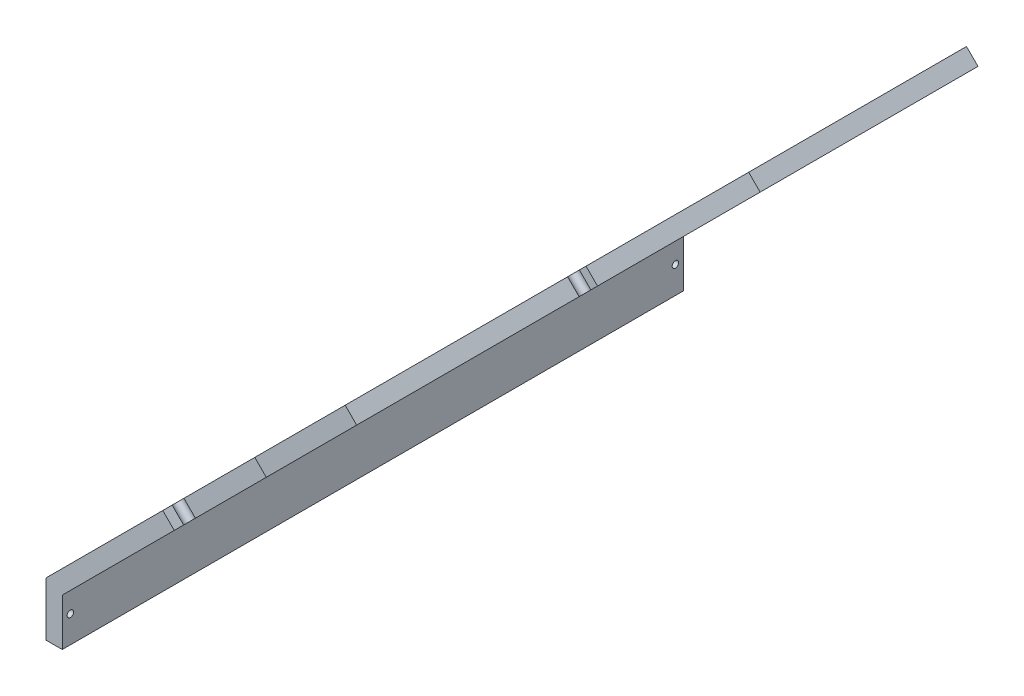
ISO-10303-21;
HEADER;
FILE_DESCRIPTION(('STEP AP214'),'2;1');
FILE_NAME('part.step','',(''),(''),'','','');
FILE_SCHEMA(('AUTOMOTIVE_DESIGN { 1 0 10303 214 1 1 1 1 }'));
ENDSEC;
DATA;
#1=APPLICATION_CONTEXT('core data for automotive mechanical design processes');
#2=APPLICATION_PROTOCOL_DEFINITION('international standard','automotive_design',2000,#1);
#3=PRODUCT_CONTEXT('',#1,'mechanical');
#4=PRODUCT('Part','Part','',(#3));
#5=PRODUCT_RELATED_PRODUCT_CATEGORY('part','',(#4));
#6=PRODUCT_DEFINITION_FORMATION('','',#4);
#7=PRODUCT_DEFINITION_CONTEXT('part definition',#1,'design');
#8=PRODUCT_DEFINITION('design','',#6,#7);
#9=PRODUCT_DEFINITION_SHAPE('','',#8);
#10=(LENGTH_UNIT() NAMED_UNIT(*) SI_UNIT(.MILLI.,.METRE.));
#11=(NAMED_UNIT(*) PLANE_ANGLE_UNIT() SI_UNIT($,.RADIAN.));
#12=(NAMED_UNIT(*) SI_UNIT($,.STERADIAN.) SOLID_ANGLE_UNIT());
#13=UNCERTAINTY_MEASURE_WITH_UNIT(LENGTH_MEASURE(1.E-05),#10,'distance_accuracy_value','');
#14=(GEOMETRIC_REPRESENTATION_CONTEXT(3) GLOBAL_UNCERTAINTY_ASSIGNED_CONTEXT((#13)) GLOBAL_UNIT_ASSIGNED_CONTEXT((#10,
#11,#12)) REPRESENTATION_CONTEXT('',''));
#15=CARTESIAN_POINT('',(0.,0.,0.));
#16=DIRECTION('',(0.,0.,1.));
#17=DIRECTION('',(1.,0.,0.));
#18=AXIS2_PLACEMENT_3D('',#15,#16,#17);
#19=CARTESIAN_POINT('',(0.,0.,191.));
#20=DIRECTION('',(0.,0.,-1.));
#21=DIRECTION('',(-1.,0.,0.));
#22=AXIS2_PLACEMENT_3D('',#19,#20,#21);
#23=PLANE('',#22);
#24=DIRECTION('',(0.707106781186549,0.707106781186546,0.));
#25=VECTOR('',#24,1.);
#26=CARTESIAN_POINT('',(90.5025969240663,105.002596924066,191.));
#27=LINE('',#26,#25);
#28=CARTESIAN_POINT('',(0.,14.5,191.));
#29=VERTEX_POINT('',#28);
#30=CARTESIAN_POINT('',(34.431457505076,48.9314575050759,191.));
#31=VERTEX_POINT('',#30);
#32=EDGE_CURVE('E299',#29,#31,#27,.T.);
#33=ORIENTED_EDGE('',*,*,#32,.T.);
#34=DIRECTION('',(-0.707106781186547,0.707106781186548,0.));
#35=VECTOR('',#34,1.);
#36=CARTESIAN_POINT('',(41.681457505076,41.6814575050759,191.));
#37=LINE('',#36,#35);
#38=CARTESIAN_POINT('',(30.8959235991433,52.4669914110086,191.));
#39=VERTEX_POINT('',#38);
#40=EDGE_CURVE('E261',#31,#39,#37,.T.);
#41=ORIENTED_EDGE('',*,*,#40,.T.);
#42=DIRECTION('',(-0.707106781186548,-0.707106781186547,0.));
#43=VECTOR('',#42,1.);
#44=CARTESIAN_POINT('',(-4.99999999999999,16.5710678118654,191.));
#45=LINE('',#44,#43);
#46=CARTESIAN_POINT('',(-4.99999999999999,16.5710678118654,191.));
#47=VERTEX_POINT('',#46);
#48=EDGE_CURVE('E303',#39,#47,#45,.T.);
#49=ORIENTED_EDGE('',*,*,#48,.T.);
#50=DIRECTION('',(0.,-1.,0.));
#51=VECTOR('',#50,1.);
#52=CARTESIAN_POINT('',(-5.,0.,191.));
#53=LINE('',#52,#51);
#54=CARTESIAN_POINT('',(-5.,0.,191.));
#55=VERTEX_POINT('',#54);
#56=EDGE_CURVE('E305',#47,#55,#53,.T.);
#57=ORIENTED_EDGE('',*,*,#56,.T.);
#58=DIRECTION('',(1.,0.,0.));
#59=VECTOR('',#58,1.);
#60=CARTESIAN_POINT('',(0.,0.,191.));
#61=LINE('',#60,#59);
#62=CARTESIAN_POINT('',(0.,0.,191.));
#63=VERTEX_POINT('',#62);
#64=EDGE_CURVE('E307',#55,#63,#61,.T.);
#65=ORIENTED_EDGE('',*,*,#64,.T.);
#66=DIRECTION('',(0.,1.,0.));
#67=VECTOR('',#66,1.);
#68=CARTESIAN_POINT('',(0.,14.5,191.));
#69=LINE('',#68,#67);
#70=EDGE_CURVE('E294',#63,#29,#69,.T.);
#71=ORIENTED_EDGE('',*,*,#70,.T.);
#72=EDGE_LOOP('',(#33,#41,#49,#57,#65,#71));
#73=FACE_BOUND('',#72,.T.);
#74=ADVANCED_FACE('F33',(#73),#23,.F.);
#75=CARTESIAN_POINT('',(0.,0.,0.));
#76=DIRECTION('',(0.,0.,-1.));
#77=DIRECTION('',(-1.,0.,0.));
#78=AXIS2_PLACEMENT_3D('',#75,#76,#77);
#79=PLANE('',#78);
#80=DIRECTION('',(0.707106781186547,-0.707106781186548,0.));
#81=VECTOR('',#80,1.);
#82=CARTESIAN_POINT('',(69.965728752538,69.9657287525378,0.));
#83=LINE('',#82,#81);
#84=CARTESIAN_POINT('',(59.1801948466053,80.7512626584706,0.));
#85=VERTEX_POINT('',#84);
#86=CARTESIAN_POINT('',(62.715728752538,77.2157287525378,0.));
#87=VERTEX_POINT('',#86);
#88=EDGE_CURVE('E257',#85,#87,#83,.T.);
#89=ORIENTED_EDGE('',*,*,#88,.F.);
#90=DIRECTION('',(-0.707106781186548,-0.707106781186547,0.));
#91=VECTOR('',#90,1.);
#92=CARTESIAN_POINT('',(-4.99999999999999,16.5710678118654,0.));
#93=LINE('',#92,#91);
#94=CARTESIAN_POINT('',(86.9670630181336,108.538130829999,0.));
#95=VERTEX_POINT('',#94);
#96=EDGE_CURVE('E320',#95,#85,#93,.T.);
#97=ORIENTED_EDGE('',*,*,#96,.F.);
#98=DIRECTION('',(-0.707106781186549,0.707106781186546,0.));
#99=VECTOR('',#98,1.);
#100=CARTESIAN_POINT('',(86.9670630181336,108.538130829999,0.));
#101=LINE('',#100,#99);
#102=CARTESIAN_POINT('',(90.5025969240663,105.002596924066,0.));
#103=VERTEX_POINT('',#102);
#104=EDGE_CURVE('E316',#103,#95,#101,.T.);
#105=ORIENTED_EDGE('',*,*,#104,.F.);
#106=DIRECTION('',(0.707106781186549,0.707106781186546,0.));
#107=VECTOR('',#106,1.);
#108=CARTESIAN_POINT('',(90.5025969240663,105.002596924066,0.));
#109=LINE('',#108,#107);
#110=EDGE_CURVE('E312',#87,#103,#109,.T.);
#111=ORIENTED_EDGE('',*,*,#110,.F.);
#112=EDGE_LOOP('',(#89,#97,#105,#111));
#113=FACE_BOUND('',#112,.T.);
#114=ADVANCED_FACE('F436',(#113),#79,.T.);
#115=CARTESIAN_POINT('',(86.9670630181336,108.538130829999,191.));
#116=DIRECTION('',(-0.707106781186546,-0.707106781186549,0.));
#117=DIRECTION('',(0.707106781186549,-0.707106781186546,0.));
#118=AXIS2_PLACEMENT_3D('',#115,#116,#117);
#119=PLANE('',#118);
#120=DIRECTION('',(0.,0.,-1.));
#121=VECTOR('',#120,1.);
#122=CARTESIAN_POINT('',(86.9670630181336,108.538130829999,191.));
#123=LINE('',#122,#121);
#124=CARTESIAN_POINT('',(86.9670630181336,108.538130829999,68.3786796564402));
#125=VERTEX_POINT('',#124);
#126=EDGE_CURVE('E216',#125,#95,#123,.T.);
#127=ORIENTED_EDGE('',*,*,#126,.F.);
#128=DIRECTION('',(-0.707106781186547,0.707106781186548,0.));
#129=VECTOR('',#128,1.);
#130=CARTESIAN_POINT('',(144.771674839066,50.7335190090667,68.37867965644));
#131=LINE('',#130,#129);
#132=CARTESIAN_POINT('',(90.5025969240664,105.002596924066,68.3786796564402));
#133=VERTEX_POINT('',#132);
#134=EDGE_CURVE('E441',#125,#133,#131,.F.);
#135=ORIENTED_EDGE('',*,*,#134,.T.);
#136=DIRECTION('',(0.,0.,-1.));
#137=VECTOR('',#136,1.);
#138=CARTESIAN_POINT('',(90.5025969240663,105.002596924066,191.));
#139=LINE('',#138,#137);
#140=EDGE_CURVE('E215',#133,#103,#139,.T.);
#141=ORIENTED_EDGE('',*,*,#140,.T.);
#142=ORIENTED_EDGE('',*,*,#104,.T.);
#143=EDGE_LOOP('',(#127,#135,#141,#142));
#144=FACE_BOUND('',#143,.T.);
#145=ADVANCED_FACE('F440',(#144),#119,.F.);
#146=CARTESIAN_POINT('',(0.,14.5,191.));
#147=DIRECTION('',(-1.,0.,0.));
#148=DIRECTION('',(0.,-1.,0.));
#149=AXIS2_PLACEMENT_3D('',#146,#147,#148);
#150=PLANE('',#149);
#151=CARTESIAN_POINT('',(0.,8.28553390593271,188.5));
#152=DIRECTION('',(-1.,0.,0.));
#153=DIRECTION('',(0.,-1.,0.));
#154=AXIS2_PLACEMENT_3D('',#151,#152,#153);
#155=CIRCLE('',#154,0.999999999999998);
#156=CARTESIAN_POINT('',(0.,7.28553390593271,188.5));
#157=VERTEX_POINT('',#156);
#158=EDGE_CURVE('E567',#157,#157,#155,.T.);
#159=ORIENTED_EDGE('',*,*,#158,.T.);
#160=EDGE_LOOP('',(#159));
#161=FACE_BOUND('',#160,.T.);
#162=CARTESIAN_POINT('',(0.,8.28553390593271,2.5));
#163=DIRECTION('',(-1.,0.,0.));
#164=DIRECTION('',(0.,-1.,0.));
#165=AXIS2_PLACEMENT_3D('',#162,#163,#164);
#166=CIRCLE('',#165,1.);
#167=CARTESIAN_POINT('',(0.,7.28553390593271,2.5));
#168=VERTEX_POINT('',#167);
#169=EDGE_CURVE('E563',#168,#168,#166,.T.);
#170=ORIENTED_EDGE('',*,*,#169,.T.);
#171=EDGE_LOOP('',(#170));
#172=FACE_BOUND('',#171,.T.);
#173=DIRECTION('',(0.,1.,0.));
#174=VECTOR('',#173,1.);
#175=CARTESIAN_POINT('',(0.,14.5,0.));
#176=LINE('',#175,#174);
#177=CARTESIAN_POINT('',(0.,0.,0.));
#178=VERTEX_POINT('',#177);
#179=CARTESIAN_POINT('',(0.,14.5,0.));
#180=VERTEX_POINT('',#179);
#181=EDGE_CURVE('E292',#178,#180,#176,.T.);
#182=ORIENTED_EDGE('',*,*,#181,.T.);
#183=DIRECTION('',(0.,0.,-1.));
#184=VECTOR('',#183,1.);
#185=CARTESIAN_POINT('',(0.,14.5,191.));
#186=LINE('',#185,#184);
#187=EDGE_CURVE('E224',#29,#180,#186,.T.);
#188=ORIENTED_EDGE('',*,*,#187,.F.);
#189=ORIENTED_EDGE('',*,*,#70,.F.);
#190=DIRECTION('',(0.,0.,-1.));
#191=VECTOR('',#190,1.);
#192=CARTESIAN_POINT('',(0.,0.,191.));
#193=LINE('',#192,#191);
#194=EDGE_CURVE('E309',#63,#178,#193,.T.);
#195=ORIENTED_EDGE('',*,*,#194,.T.);
#196=EDGE_LOOP('',(#182,#188,#189,#195));
#197=FACE_BOUND('',#196,.T.);
#198=ADVANCED_FACE('F35',(#161,#172,#197),#150,.F.);
#199=CARTESIAN_POINT('',(90.5025969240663,105.002596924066,191.));
#200=DIRECTION('',(-0.707106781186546,0.707106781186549,0.));
#201=DIRECTION('',(-0.707106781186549,-0.707106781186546,0.));
#202=AXIS2_PLACEMENT_3D('',#199,#200,#201);
#203=PLANE('',#202);
#204=CARTESIAN_POINT('',(76.6091628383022,91.1091628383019,2.50000000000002));
#205=DIRECTION('',(-0.707106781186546,0.707106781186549,0.));
#206=DIRECTION('',(-0.707106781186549,-0.707106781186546,0.));
#207=AXIS2_PLACEMENT_3D('',#204,#205,#206);
#208=CIRCLE('',#207,1.);
#209=CARTESIAN_POINT('',(75.9020560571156,90.4020560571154,2.50000000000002));
#210=VERTEX_POINT('',#209);
#211=EDGE_CURVE('E517',#210,#210,#208,.T.);
#212=ORIENTED_EDGE('',*,*,#211,.T.);
#213=EDGE_LOOP('',(#212));
#214=FACE_BOUND('',#213,.T.);
#215=CARTESIAN_POINT('',(16.4834957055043,30.9834957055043,2.50000000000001));
#216=DIRECTION('',(-0.707106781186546,0.707106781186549,0.));
#217=DIRECTION('',(-0.707106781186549,-0.707106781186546,0.));
#218=AXIS2_PLACEMENT_3D('',#215,#216,#217);
#219=CIRCLE('',#218,1.);
#220=CARTESIAN_POINT('',(15.7763889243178,30.2763889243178,2.50000000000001));
#221=VERTEX_POINT('',#220);
#222=EDGE_CURVE('E521',#221,#221,#219,.T.);
#223=ORIENTED_EDGE('',*,*,#222,.T.);
#224=EDGE_LOOP('',(#223));
#225=FACE_BOUND('',#224,.T.);
#226=CARTESIAN_POINT('',(16.4834957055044,30.9834957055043,188.5));
#227=DIRECTION('',(-0.707106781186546,0.707106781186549,0.));
#228=DIRECTION('',(-0.707106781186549,-0.707106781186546,0.));
#229=AXIS2_PLACEMENT_3D('',#226,#227,#228);
#230=CIRCLE('',#229,0.999999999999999);
#231=CARTESIAN_POINT('',(15.7763889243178,30.2763889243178,188.5));
#232=VERTEX_POINT('',#231);
#233=EDGE_CURVE('E525',#232,#232,#230,.T.);
#234=ORIENTED_EDGE('',*,*,#233,.T.);
#235=EDGE_LOOP('',(#234));
#236=FACE_BOUND('',#235,.T.);
#237=CARTESIAN_POINT('',(76.6091628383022,91.1091628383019,188.5));
#238=DIRECTION('',(-0.707106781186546,0.707106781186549,0.));
#239=DIRECTION('',(-0.707106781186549,-0.707106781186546,0.));
#240=AXIS2_PLACEMENT_3D('',#237,#238,#239);
#241=CIRCLE('',#240,0.999999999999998);
#242=CARTESIAN_POINT('',(75.9020560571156,90.4020560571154,188.5));
#243=VERTEX_POINT('',#242);
#244=EDGE_CURVE('E529',#243,#243,#241,.T.);
#245=ORIENTED_EDGE('',*,*,#244,.T.);
#246=EDGE_LOOP('',(#245));
#247=FACE_BOUND('',#246,.T.);
#248=CARTESIAN_POINT('',(92.2703638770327,106.770363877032,95.5));
#249=DIRECTION('',(-0.707106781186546,0.707106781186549,0.));
#250=DIRECTION('',(-0.707106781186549,-0.707106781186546,0.));
#251=AXIS2_PLACEMENT_3D('',#248,#249,#250);
#252=CIRCLE('',#251,0.999999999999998);
#253=CARTESIAN_POINT('',(91.5632570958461,106.063257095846,95.5));
#254=VERTEX_POINT('',#253);
#255=EDGE_CURVE('E200',#254,#254,#252,.T.);
#256=ORIENTED_EDGE('',*,*,#255,.T.);
#257=EDGE_LOOP('',(#256));
#258=FACE_BOUND('',#257,.T.);
#259=DIRECTION('',(0.707106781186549,0.707106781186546,0.));
#260=VECTOR('',#259,1.);
#261=CARTESIAN_POINT('',(90.5025969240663,105.002596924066,120.5));
#262=LINE('',#261,#260);
#263=CARTESIAN_POINT('',(92.0025969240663,106.502596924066,120.5));
#264=VERTEX_POINT('',#263);
#265=CARTESIAN_POINT('',(94.038130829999,108.538130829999,120.5));
#266=VERTEX_POINT('',#265);
#267=EDGE_CURVE('E238',#264,#266,#262,.T.);
#268=ORIENTED_EDGE('',*,*,#267,.F.);
#269=CARTESIAN_POINT('',(91.2525969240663,105.752596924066,121.56066017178));
#270=DIRECTION('',(-0.707106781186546,0.707106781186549,0.));
#271=DIRECTION('',(-0.707106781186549,-0.707106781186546,0.));
#272=AXIS2_PLACEMENT_3D('',#269,#270,#271);
#273=CIRCLE('',#272,1.50000000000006);
#274=CARTESIAN_POINT('',(90.5025969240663,105.002596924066,122.62132034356));
#275=VERTEX_POINT('',#274);
#276=EDGE_CURVE('E47',#264,#275,#273,.T.);
#277=ORIENTED_EDGE('',*,*,#276,.T.);
#278=CARTESIAN_POINT('',(90.5025969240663,105.002596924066,191.));
#279=VERTEX_POINT('',#278);
#280=EDGE_CURVE('E209',#279,#275,#139,.T.);
#281=ORIENTED_EDGE('',*,*,#280,.F.);
#282=CARTESIAN_POINT('',(62.715728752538,77.2157287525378,191.));
#283=VERTEX_POINT('',#282);
#284=EDGE_CURVE('E297',#283,#279,#27,.T.);
#285=ORIENTED_EDGE('',*,*,#284,.F.);
#286=DIRECTION('',(0.,0.,-1.));
#287=VECTOR('',#286,1.);
#288=CARTESIAN_POINT('',(62.715728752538,77.2157287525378,191.));
#289=LINE('',#288,#287);
#290=CARTESIAN_POINT('',(62.715728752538,77.2157287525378,188.12132034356));
#291=VERTEX_POINT('',#290);
#292=EDGE_CURVE('E367',#283,#291,#289,.T.);
#293=ORIENTED_EDGE('',*,*,#292,.T.);
#294=CARTESIAN_POINT('',(61.965728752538,76.4657287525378,187.06066017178));
#295=DIRECTION('',(-0.707106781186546,0.707106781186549,0.));
#296=DIRECTION('',(-0.707106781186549,-0.707106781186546,0.));
#297=AXIS2_PLACEMENT_3D('',#294,#295,#296);
#298=CIRCLE('',#297,1.50000000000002);
#299=CARTESIAN_POINT('',(61.2157287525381,75.7157287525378,186.));
#300=VERTEX_POINT('',#299);
#301=EDGE_CURVE('E376',#291,#300,#298,.T.);
#302=ORIENTED_EDGE('',*,*,#301,.T.);
#303=DIRECTION('',(-0.707106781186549,-0.707106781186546,0.));
#304=VECTOR('',#303,1.);
#305=CARTESIAN_POINT('',(90.5025969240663,105.002596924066,186.));
#306=LINE('',#305,#304);
#307=CARTESIAN_POINT('',(35.931457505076,50.4314575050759,186.));
#308=VERTEX_POINT('',#307);
#309=EDGE_CURVE('E379',#300,#308,#306,.T.);
#310=ORIENTED_EDGE('',*,*,#309,.T.);
#311=CARTESIAN_POINT('',(35.181457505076,49.6814575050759,187.06066017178));
#312=DIRECTION('',(-0.707106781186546,0.707106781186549,0.));
#313=DIRECTION('',(-0.707106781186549,-0.707106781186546,0.));
#314=AXIS2_PLACEMENT_3D('',#311,#312,#313);
#315=CIRCLE('',#314,1.5);
#316=CARTESIAN_POINT('',(34.431457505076,48.9314575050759,188.12132034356));
#317=VERTEX_POINT('',#316);
#318=EDGE_CURVE('E382',#308,#317,#315,.T.);
#319=ORIENTED_EDGE('',*,*,#318,.T.);
#320=DIRECTION('',(0.,0.,1.));
#321=VECTOR('',#320,1.);
#322=CARTESIAN_POINT('',(34.431457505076,48.9314575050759,191.));
#323=LINE('',#322,#321);
#324=EDGE_CURVE('E373',#317,#31,#323,.T.);
#325=ORIENTED_EDGE('',*,*,#324,.T.);
#326=ORIENTED_EDGE('',*,*,#32,.F.);
#327=ORIENTED_EDGE('',*,*,#187,.T.);
#328=CARTESIAN_POINT('',(34.431457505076,48.9314575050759,0.));
#329=VERTEX_POINT('',#328);
#330=EDGE_CURVE('E313',#180,#329,#109,.T.);
#331=ORIENTED_EDGE('',*,*,#330,.T.);
#332=DIRECTION('',(0.,0.,1.));
#333=VECTOR('',#332,1.);
#334=CARTESIAN_POINT('',(34.4314575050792,48.9314575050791,191.000000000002));
#335=LINE('',#334,#333);
#336=CARTESIAN_POINT('',(34.4314575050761,48.9314575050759,2.87867965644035));
#337=VERTEX_POINT('',#336);
#338=EDGE_CURVE('E402',#329,#337,#335,.T.);
#339=ORIENTED_EDGE('',*,*,#338,.T.);
#340=CARTESIAN_POINT('',(35.181457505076,49.6814575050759,3.93933982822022));
#341=DIRECTION('',(-0.707106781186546,0.707106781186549,0.));
#342=DIRECTION('',(-0.707106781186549,-0.707106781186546,0.));
#343=AXIS2_PLACEMENT_3D('',#340,#341,#342);
#344=CIRCLE('',#343,1.49999999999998);
#345=CARTESIAN_POINT('',(35.931457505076,50.4314575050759,5.00000000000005));
#346=VERTEX_POINT('',#345);
#347=EDGE_CURVE('E413',#337,#346,#344,.T.);
#348=ORIENTED_EDGE('',*,*,#347,.T.);
#349=DIRECTION('',(0.707106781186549,0.707106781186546,0.));
#350=VECTOR('',#349,1.);
#351=CARTESIAN_POINT('',(90.5025969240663,105.002596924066,5.));
#352=LINE('',#351,#350);
#353=CARTESIAN_POINT('',(61.215728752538,75.7157287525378,5.00000000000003));
#354=VERTEX_POINT('',#353);
#355=EDGE_CURVE('E415',#346,#354,#352,.T.);
#356=ORIENTED_EDGE('',*,*,#355,.T.);
#357=CARTESIAN_POINT('',(61.965728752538,76.4657287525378,3.93933982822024));
#358=DIRECTION('',(-0.707106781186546,0.707106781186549,0.));
#359=DIRECTION('',(-0.707106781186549,-0.707106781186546,0.));
#360=AXIS2_PLACEMENT_3D('',#357,#358,#359);
#361=CIRCLE('',#360,1.49999999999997);
#362=CARTESIAN_POINT('',(62.715728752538,77.2157287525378,2.87867965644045));
#363=VERTEX_POINT('',#362);
#364=EDGE_CURVE('E237',#354,#363,#361,.T.);
#365=ORIENTED_EDGE('',*,*,#364,.T.);
#366=DIRECTION('',(0.,0.,-1.));
#367=VECTOR('',#366,1.);
#368=CARTESIAN_POINT('',(62.715728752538,77.2157287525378,191.));
#369=LINE('',#368,#367);
#370=EDGE_CURVE('E410',#363,#87,#369,.T.);
#371=ORIENTED_EDGE('',*,*,#370,.T.);
#372=ORIENTED_EDGE('',*,*,#110,.T.);
#373=ORIENTED_EDGE('',*,*,#140,.F.);
#374=CARTESIAN_POINT('',(91.2525969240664,105.752596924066,69.4393398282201));
#375=DIRECTION('',(-0.707106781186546,0.707106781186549,0.));
#376=DIRECTION('',(-0.707106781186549,-0.707106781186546,0.));
#377=AXIS2_PLACEMENT_3D('',#374,#375,#376);
#378=CIRCLE('',#377,1.50000000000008);
#379=CARTESIAN_POINT('',(92.0025969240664,106.502596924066,70.5));
#380=VERTEX_POINT('',#379);
#381=EDGE_CURVE('E267',#133,#380,#378,.T.);
#382=ORIENTED_EDGE('',*,*,#381,.T.);
#383=DIRECTION('',(-0.707106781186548,-0.707106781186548,0.));
#384=VECTOR('',#383,1.);
#385=CARTESIAN_POINT('',(90.5025969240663,105.002596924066,70.5));
#386=LINE('',#385,#384);
#387=CARTESIAN_POINT('',(94.038130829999,108.538130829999,70.5));
#388=VERTEX_POINT('',#387);
#389=EDGE_CURVE('E243',#388,#380,#386,.T.);
#390=ORIENTED_EDGE('',*,*,#389,.F.);
#391=DIRECTION('',(0.,0.,-1.));
#392=VECTOR('',#391,1.);
#393=CARTESIAN_POINT('',(94.038130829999,108.538130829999,120.5));
#394=LINE('',#393,#392);
#395=EDGE_CURVE('E247',#266,#388,#394,.T.);
#396=ORIENTED_EDGE('',*,*,#395,.F.);
#397=EDGE_LOOP('',(#268,#277,#281,#285,#293,#302,#310,#319,#325,#326,#327,#331,#339,#348,#356,
#365,#371,#372,#373,#382,#390,#396));
#398=FACE_BOUND('',#397,.T.);
#399=ADVANCED_FACE('F278',(#214,#225,#236,#247,#258,#398),#203,.F.);
#400=ORIENTED_EDGE('',*,*,#280,.T.);
#401=DIRECTION('',(-0.707106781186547,0.707106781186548,0.));
#402=VECTOR('',#401,1.);
#403=CARTESIAN_POINT('',(144.771674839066,50.7335190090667,122.62132034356));
#404=LINE('',#403,#402);
#405=CARTESIAN_POINT('',(86.9670630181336,108.538130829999,122.62132034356));
#406=VERTEX_POINT('',#405);
#407=EDGE_CURVE('E195',#275,#406,#404,.T.);
#408=ORIENTED_EDGE('',*,*,#407,.T.);
#409=CARTESIAN_POINT('',(86.9670630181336,108.538130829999,191.));
#410=VERTEX_POINT('',#409);
#411=EDGE_CURVE('E206',#410,#406,#123,.T.);
#412=ORIENTED_EDGE('',*,*,#411,.F.);
#413=DIRECTION('',(-0.707106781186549,0.707106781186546,0.));
#414=VECTOR('',#413,1.);
#415=CARTESIAN_POINT('',(86.9670630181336,108.538130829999,191.));
#416=LINE('',#415,#414);
#417=EDGE_CURVE('E301',#279,#410,#416,.T.);
#418=ORIENTED_EDGE('',*,*,#417,.F.);
#419=EDGE_LOOP('',(#400,#408,#412,#418));
#420=FACE_BOUND('',#419,.T.);
#421=ADVANCED_FACE('F204',(#420),#119,.F.);
#422=CARTESIAN_POINT('',(-4.99999999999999,16.5710678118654,191.));
#423=DIRECTION('',(0.707106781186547,-0.707106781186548,0.));
#424=DIRECTION('',(0.707106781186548,0.707106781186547,0.));
#425=AXIS2_PLACEMENT_3D('',#422,#423,#424);
#426=PLANE('',#425);
#427=CARTESIAN_POINT('',(73.0736289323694,94.6446967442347,2.50000000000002));
#428=DIRECTION('',(-0.707106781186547,0.707106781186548,0.));
#429=DIRECTION('',(-0.707106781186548,-0.707106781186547,0.));
#430=AXIS2_PLACEMENT_3D('',#427,#428,#429);
#431=CIRCLE('',#430,1.);
#432=CARTESIAN_POINT('',(72.3665221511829,93.9375899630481,2.50000000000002));
#433=VERTEX_POINT('',#432);
#434=EDGE_CURVE('E560',#433,#433,#431,.T.);
#435=ORIENTED_EDGE('',*,*,#434,.F.);
#436=EDGE_LOOP('',(#435));
#437=FACE_BOUND('',#436,.T.);
#438=CARTESIAN_POINT('',(12.9479617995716,34.519029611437,2.50000000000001));
#439=DIRECTION('',(-0.707106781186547,0.707106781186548,0.));
#440=DIRECTION('',(-0.707106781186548,-0.707106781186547,0.));
#441=AXIS2_PLACEMENT_3D('',#438,#439,#440);
#442=CIRCLE('',#441,1.);
#443=CARTESIAN_POINT('',(12.2408550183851,33.8119228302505,2.50000000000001));
#444=VERTEX_POINT('',#443);
#445=EDGE_CURVE('E556',#444,#444,#442,.T.);
#446=ORIENTED_EDGE('',*,*,#445,.F.);
#447=EDGE_LOOP('',(#446));
#448=FACE_BOUND('',#447,.T.);
#449=CARTESIAN_POINT('',(12.9479617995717,34.5190296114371,188.5));
#450=DIRECTION('',(-0.707106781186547,0.707106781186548,0.));
#451=DIRECTION('',(-0.707106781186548,-0.707106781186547,0.));
#452=AXIS2_PLACEMENT_3D('',#449,#450,#451);
#453=CIRCLE('',#452,0.999999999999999);
#454=CARTESIAN_POINT('',(12.2408550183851,33.8119228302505,188.5));
#455=VERTEX_POINT('',#454);
#456=EDGE_CURVE('E552',#455,#455,#453,.T.);
#457=ORIENTED_EDGE('',*,*,#456,.F.);
#458=EDGE_LOOP('',(#457));
#459=FACE_BOUND('',#458,.T.);
#460=CARTESIAN_POINT('',(73.0736289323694,94.6446967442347,188.5));
#461=DIRECTION('',(-0.707106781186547,0.707106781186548,0.));
#462=DIRECTION('',(-0.707106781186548,-0.707106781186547,0.));
#463=AXIS2_PLACEMENT_3D('',#460,#461,#462);
#464=CIRCLE('',#463,0.999999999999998);
#465=CARTESIAN_POINT('',(72.3665221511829,93.9375899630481,188.5));
#466=VERTEX_POINT('',#465);
#467=EDGE_CURVE('E548',#466,#466,#464,.T.);
#468=ORIENTED_EDGE('',*,*,#467,.F.);
#469=EDGE_LOOP('',(#468));
#470=FACE_BOUND('',#469,.T.);
#471=CARTESIAN_POINT('',(88.7348299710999,110.305897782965,95.5));
#472=DIRECTION('',(-0.707106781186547,0.707106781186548,0.));
#473=DIRECTION('',(-0.707106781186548,-0.707106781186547,0.));
#474=AXIS2_PLACEMENT_3D('',#471,#472,#473);
#475=CIRCLE('',#474,0.999999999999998);
#476=CARTESIAN_POINT('',(88.0277231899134,109.598791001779,95.5));
#477=VERTEX_POINT('',#476);
#478=EDGE_CURVE('E533',#477,#477,#475,.T.);
#479=ORIENTED_EDGE('',*,*,#478,.F.);
#480=EDGE_LOOP('',(#479));
#481=FACE_BOUND('',#480,.T.);
#482=ORIENTED_EDGE('',*,*,#411,.T.);
#483=CARTESIAN_POINT('',(87.7170630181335,109.288130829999,121.56066017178));
#484=DIRECTION('',(-0.707106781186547,0.707106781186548,0.));
#485=DIRECTION('',(-0.707106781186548,-0.707106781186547,0.));
#486=AXIS2_PLACEMENT_3D('',#483,#484,#485);
#487=CIRCLE('',#486,1.50000000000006);
#488=CARTESIAN_POINT('',(88.4670630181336,110.038130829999,120.5));
#489=VERTEX_POINT('',#488);
#490=EDGE_CURVE('E192',#489,#406,#487,.T.);
#491=ORIENTED_EDGE('',*,*,#490,.F.);
#492=DIRECTION('',(0.707106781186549,0.707106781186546,0.));
#493=VECTOR('',#492,1.);
#494=CARTESIAN_POINT('',(86.9670630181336,108.538130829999,120.5));
#495=LINE('',#494,#493);
#496=CARTESIAN_POINT('',(90.5025969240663,112.073664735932,120.5));
#497=VERTEX_POINT('',#496);
#498=EDGE_CURVE('E235',#489,#497,#495,.T.);
#499=ORIENTED_EDGE('',*,*,#498,.T.);
#500=DIRECTION('',(0.,0.,-1.));
#501=VECTOR('',#500,1.);
#502=CARTESIAN_POINT('',(90.5025969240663,112.073664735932,120.5));
#503=LINE('',#502,#501);
#504=CARTESIAN_POINT('',(90.5025969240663,112.073664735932,70.5));
#505=VERTEX_POINT('',#504);
#506=EDGE_CURVE('E236',#497,#505,#503,.T.);
#507=ORIENTED_EDGE('',*,*,#506,.T.);
#508=DIRECTION('',(-0.707106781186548,-0.707106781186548,0.));
#509=VECTOR('',#508,1.);
#510=CARTESIAN_POINT('',(86.9670630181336,108.538130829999,70.5));
#511=LINE('',#510,#509);
#512=CARTESIAN_POINT('',(88.4670630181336,110.038130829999,70.5));
#513=VERTEX_POINT('',#512);
#514=EDGE_CURVE('E250',#505,#513,#511,.T.);
#515=ORIENTED_EDGE('',*,*,#514,.T.);
#516=CARTESIAN_POINT('',(87.7170630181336,109.288130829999,69.4393398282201));
#517=DIRECTION('',(-0.707106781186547,0.707106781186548,0.));
#518=DIRECTION('',(-0.707106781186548,-0.707106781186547,0.));
#519=AXIS2_PLACEMENT_3D('',#516,#517,#518);
#520=CIRCLE('',#519,1.50000000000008);
#521=EDGE_CURVE('E55',#125,#513,#520,.T.);
#522=ORIENTED_EDGE('',*,*,#521,.F.);
#523=ORIENTED_EDGE('',*,*,#126,.T.);
#524=ORIENTED_EDGE('',*,*,#96,.T.);
#525=DIRECTION('',(0.,0.,-1.));
#526=VECTOR('',#525,1.);
#527=CARTESIAN_POINT('',(59.1801948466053,80.7512626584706,2.87867965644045));
#528=LINE('',#527,#526);
#529=CARTESIAN_POINT('',(59.1801948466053,80.7512626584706,2.87867965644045));
#530=VERTEX_POINT('',#529);
#531=EDGE_CURVE('E397',#530,#85,#528,.T.);
#532=ORIENTED_EDGE('',*,*,#531,.F.);
#533=CARTESIAN_POINT('',(58.4301948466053,80.0012626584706,3.93933982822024));
#534=DIRECTION('',(-0.707106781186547,0.707106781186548,0.));
#535=DIRECTION('',(-0.707106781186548,-0.707106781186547,0.));
#536=AXIS2_PLACEMENT_3D('',#533,#534,#535);
#537=CIRCLE('',#536,1.49999999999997);
#538=CARTESIAN_POINT('',(57.6801948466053,79.2512626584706,5.00000000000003));
#539=VERTEX_POINT('',#538);
#540=EDGE_CURVE('E394',#539,#530,#537,.T.);
#541=ORIENTED_EDGE('',*,*,#540,.F.);
#542=DIRECTION('',(0.707106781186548,0.707106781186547,0.));
#543=VECTOR('',#542,1.);
#544=CARTESIAN_POINT('',(32.3959235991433,53.9669914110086,5.00000000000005));
#545=LINE('',#544,#543);
#546=CARTESIAN_POINT('',(32.3959235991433,53.9669914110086,5.00000000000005));
#547=VERTEX_POINT('',#546);
#548=EDGE_CURVE('E391',#547,#539,#545,.T.);
#549=ORIENTED_EDGE('',*,*,#548,.F.);
#550=CARTESIAN_POINT('',(31.6459235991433,53.2169914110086,3.93933982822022));
#551=DIRECTION('',(-0.707106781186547,0.707106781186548,0.));
#552=DIRECTION('',(-0.707106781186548,-0.707106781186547,0.));
#553=AXIS2_PLACEMENT_3D('',#550,#551,#552);
#554=CIRCLE('',#553,1.49999999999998);
#555=CARTESIAN_POINT('',(30.8959235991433,52.4669914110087,2.87867965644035));
#556=VERTEX_POINT('',#555);
#557=EDGE_CURVE('E388',#556,#547,#554,.T.);
#558=ORIENTED_EDGE('',*,*,#557,.F.);
#559=DIRECTION('',(0.,0.,1.));
#560=VECTOR('',#559,1.);
#561=CARTESIAN_POINT('',(30.8959235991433,52.4669914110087,2.87867965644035));
#562=LINE('',#561,#560);
#563=CARTESIAN_POINT('',(30.8959235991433,52.4669914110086,0.));
#564=VERTEX_POINT('',#563);
#565=EDGE_CURVE('E385',#564,#556,#562,.T.);
#566=ORIENTED_EDGE('',*,*,#565,.F.);
#567=CARTESIAN_POINT('',(-4.99999999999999,16.5710678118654,0.));
#568=VERTEX_POINT('',#567);
#569=EDGE_CURVE('E319',#564,#568,#93,.T.);
#570=ORIENTED_EDGE('',*,*,#569,.T.);
#571=DIRECTION('',(0.,0.,-1.));
#572=VECTOR('',#571,1.);
#573=CARTESIAN_POINT('',(-4.99999999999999,16.5710678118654,191.));
#574=LINE('',#573,#572);
#575=EDGE_CURVE('E219',#47,#568,#574,.T.);
#576=ORIENTED_EDGE('',*,*,#575,.F.);
#577=ORIENTED_EDGE('',*,*,#48,.F.);
#578=DIRECTION('',(0.,0.,1.));
#579=VECTOR('',#578,1.);
#580=CARTESIAN_POINT('',(30.8959235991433,52.4669914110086,188.12132034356));
#581=LINE('',#580,#579);
#582=CARTESIAN_POINT('',(30.8959235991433,52.4669914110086,188.12132034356));
#583=VERTEX_POINT('',#582);
#584=EDGE_CURVE('E352',#583,#39,#581,.T.);
#585=ORIENTED_EDGE('',*,*,#584,.F.);
#586=CARTESIAN_POINT('',(31.6459235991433,53.2169914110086,187.06066017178));
#587=DIRECTION('',(-0.707106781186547,0.707106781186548,0.));
#588=DIRECTION('',(-0.707106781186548,-0.707106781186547,0.));
#589=AXIS2_PLACEMENT_3D('',#586,#587,#588);
#590=CIRCLE('',#589,1.5);
#591=CARTESIAN_POINT('',(32.3959235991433,53.9669914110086,186.));
#592=VERTEX_POINT('',#591);
#593=EDGE_CURVE('E355',#592,#583,#590,.T.);
#594=ORIENTED_EDGE('',*,*,#593,.F.);
#595=DIRECTION('',(-0.707106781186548,-0.707106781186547,0.));
#596=VECTOR('',#595,1.);
#597=CARTESIAN_POINT('',(57.6801948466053,79.2512626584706,186.));
#598=LINE('',#597,#596);
#599=CARTESIAN_POINT('',(57.6801948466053,79.2512626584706,186.));
#600=VERTEX_POINT('',#599);
#601=EDGE_CURVE('E361',#600,#592,#598,.T.);
#602=ORIENTED_EDGE('',*,*,#601,.F.);
#603=CARTESIAN_POINT('',(58.4301948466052,80.0012626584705,187.06066017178));
#604=DIRECTION('',(-0.707106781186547,0.707106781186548,0.));
#605=DIRECTION('',(-0.707106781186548,-0.707106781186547,0.));
#606=AXIS2_PLACEMENT_3D('',#603,#604,#605);
#607=CIRCLE('',#606,1.50000000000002);
#608=CARTESIAN_POINT('',(59.1801948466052,80.7512626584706,188.12132034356));
#609=VERTEX_POINT('',#608);
#610=EDGE_CURVE('E445',#609,#600,#607,.T.);
#611=ORIENTED_EDGE('',*,*,#610,.F.);
#612=DIRECTION('',(0.,0.,-1.));
#613=VECTOR('',#612,1.);
#614=CARTESIAN_POINT('',(59.1801948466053,80.7512626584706,188.12132034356));
#615=LINE('',#614,#613);
#616=CARTESIAN_POINT('',(59.1801948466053,80.7512626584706,191.));
#617=VERTEX_POINT('',#616);
#618=EDGE_CURVE('E442',#617,#609,#615,.T.);
#619=ORIENTED_EDGE('',*,*,#618,.F.);
#620=EDGE_CURVE('E214',#410,#617,#45,.T.);
#621=ORIENTED_EDGE('',*,*,#620,.F.);
#622=EDGE_LOOP('',(#482,#491,#499,#507,#515,#522,#523,#524,#532,#541,#549,#558,#566,#570,#576,
#577,#585,#594,#602,#611,#619,#621));
#623=FACE_BOUND('',#622,.T.);
#624=ADVANCED_FACE('F211',(#437,#448,#459,#470,#481,#623),#426,.F.);
#625=CARTESIAN_POINT('',(-5.,0.,191.));
#626=DIRECTION('',(1.,0.,0.));
#627=DIRECTION('',(0.,1.,0.));
#628=AXIS2_PLACEMENT_3D('',#625,#626,#627);
#629=PLANE('',#628);
#630=CARTESIAN_POINT('',(-5.,8.28553390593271,188.5));
#631=DIRECTION('',(-1.,0.,0.));
#632=DIRECTION('',(0.,-1.,0.));
#633=AXIS2_PLACEMENT_3D('',#630,#631,#632);
#634=CIRCLE('',#633,0.999999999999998);
#635=CARTESIAN_POINT('',(-5.,7.28553390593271,188.5));
#636=VERTEX_POINT('',#635);
#637=EDGE_CURVE('E570',#636,#636,#634,.T.);
#638=ORIENTED_EDGE('',*,*,#637,.F.);
#639=EDGE_LOOP('',(#638));
#640=FACE_BOUND('',#639,.T.);
#641=CARTESIAN_POINT('',(-5.,8.28553390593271,2.5));
#642=DIRECTION('',(-1.,0.,0.));
#643=DIRECTION('',(0.,-1.,0.));
#644=AXIS2_PLACEMENT_3D('',#641,#642,#643);
#645=CIRCLE('',#644,1.);
#646=CARTESIAN_POINT('',(-5.,7.28553390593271,2.5));
#647=VERTEX_POINT('',#646);
#648=EDGE_CURVE('E564',#647,#647,#645,.T.);
#649=ORIENTED_EDGE('',*,*,#648,.F.);
#650=EDGE_LOOP('',(#649));
#651=FACE_BOUND('',#650,.T.);
#652=DIRECTION('',(0.,-1.,0.));
#653=VECTOR('',#652,1.);
#654=CARTESIAN_POINT('',(-5.,0.,0.));
#655=LINE('',#654,#653);
#656=CARTESIAN_POINT('',(-5.,0.,0.));
#657=VERTEX_POINT('',#656);
#658=EDGE_CURVE('E323',#568,#657,#655,.T.);
#659=ORIENTED_EDGE('',*,*,#658,.T.);
#660=DIRECTION('',(0.,0.,-1.));
#661=VECTOR('',#660,1.);
#662=CARTESIAN_POINT('',(-5.,0.,191.));
#663=LINE('',#662,#661);
#664=EDGE_CURVE('E327',#55,#657,#663,.T.);
#665=ORIENTED_EDGE('',*,*,#664,.F.);
#666=ORIENTED_EDGE('',*,*,#56,.F.);
#667=ORIENTED_EDGE('',*,*,#575,.T.);
#668=EDGE_LOOP('',(#659,#665,#666,#667));
#669=FACE_BOUND('',#668,.T.);
#670=ADVANCED_FACE('F338',(#640,#651,#669),#629,.F.);
#671=CARTESIAN_POINT('',(0.,0.,191.));
#672=DIRECTION('',(0.,1.,0.));
#673=DIRECTION('',(-1.,0.,0.));
#674=AXIS2_PLACEMENT_3D('',#671,#672,#673);
#675=PLANE('',#674);
#676=DIRECTION('',(1.,0.,0.));
#677=VECTOR('',#676,1.);
#678=CARTESIAN_POINT('',(0.,0.,0.));
#679=LINE('',#678,#677);
#680=EDGE_CURVE('E298',#657,#178,#679,.T.);
#681=ORIENTED_EDGE('',*,*,#680,.T.);
#682=ORIENTED_EDGE('',*,*,#194,.F.);
#683=ORIENTED_EDGE('',*,*,#64,.F.);
#684=ORIENTED_EDGE('',*,*,#664,.T.);
#685=EDGE_LOOP('',(#681,#682,#683,#684));
#686=FACE_BOUND('',#685,.T.);
#687=ADVANCED_FACE('F345',(#686),#675,.F.);
#688=ORIENTED_EDGE('',*,*,#620,.T.);
#689=DIRECTION('',(0.707106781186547,-0.707106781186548,0.));
#690=VECTOR('',#689,1.);
#691=CARTESIAN_POINT('',(69.965728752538,69.9657287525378,191.));
#692=LINE('',#691,#690);
#693=EDGE_CURVE('E259',#617,#283,#692,.T.);
#694=ORIENTED_EDGE('',*,*,#693,.T.);
#695=ORIENTED_EDGE('',*,*,#284,.T.);
#696=ORIENTED_EDGE('',*,*,#417,.T.);
#697=EDGE_LOOP('',(#688,#694,#695,#696));
#698=FACE_BOUND('',#697,.T.);
#699=ADVANCED_FACE('F464',(#698),#23,.F.);
#700=DIRECTION('',(-0.707106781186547,0.707106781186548,0.));
#701=VECTOR('',#700,1.);
#702=CARTESIAN_POINT('',(41.681457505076,41.6814575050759,0.));
#703=LINE('',#702,#701);
#704=EDGE_CURVE('E255',#329,#564,#703,.T.);
#705=ORIENTED_EDGE('',*,*,#704,.F.);
#706=ORIENTED_EDGE('',*,*,#330,.F.);
#707=ORIENTED_EDGE('',*,*,#181,.F.);
#708=ORIENTED_EDGE('',*,*,#680,.F.);
#709=ORIENTED_EDGE('',*,*,#658,.F.);
#710=ORIENTED_EDGE('',*,*,#569,.F.);
#711=EDGE_LOOP('',(#705,#706,#707,#708,#709,#710));
#712=FACE_BOUND('',#711,.T.);
#713=ADVANCED_FACE('F342',(#712),#79,.T.);
#714=CARTESIAN_POINT('',(90.5025969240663,105.002596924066,120.5));
#715=DIRECTION('',(0.,0.,1.));
#716=DIRECTION('',(1.,0.,0.));
#717=AXIS2_PLACEMENT_3D('',#714,#715,#716);
#718=PLANE('',#717);
#719=DIRECTION('',(-0.707106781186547,0.707106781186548,0.));
#720=VECTOR('',#719,1.);
#721=CARTESIAN_POINT('',(146.271674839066,52.2335190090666,120.5));
#722=LINE('',#721,#720);
#723=EDGE_CURVE('E11',#264,#489,#722,.T.);
#724=ORIENTED_EDGE('',*,*,#723,.F.);
#725=ORIENTED_EDGE('',*,*,#267,.T.);
#726=DIRECTION('',(-0.707106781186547,0.707106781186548,0.));
#727=VECTOR('',#726,1.);
#728=CARTESIAN_POINT('',(94.038130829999,108.538130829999,120.5));
#729=LINE('',#728,#727);
#730=EDGE_CURVE('E246',#266,#497,#729,.T.);
#731=ORIENTED_EDGE('',*,*,#730,.T.);
#732=ORIENTED_EDGE('',*,*,#498,.F.);
#733=EDGE_LOOP('',(#724,#725,#731,#732));
#734=FACE_BOUND('',#733,.T.);
#735=ADVANCED_FACE('F493',(#734),#718,.T.);
#736=CARTESIAN_POINT('',(90.5025969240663,105.002596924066,70.5));
#737=DIRECTION('',(0.,0.,-1.));
#738=DIRECTION('',(-1.,0.,0.));
#739=AXIS2_PLACEMENT_3D('',#736,#737,#738);
#740=PLANE('',#739);
#741=DIRECTION('',(-0.707106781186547,0.707106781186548,0.));
#742=VECTOR('',#741,1.);
#743=CARTESIAN_POINT('',(146.271674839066,52.2335190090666,70.5));
#744=LINE('',#743,#742);
#745=EDGE_CURVE('E41',#513,#380,#744,.F.);
#746=ORIENTED_EDGE('',*,*,#745,.F.);
#747=ORIENTED_EDGE('',*,*,#514,.F.);
#748=DIRECTION('',(-0.707106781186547,0.707106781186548,0.));
#749=VECTOR('',#748,1.);
#750=CARTESIAN_POINT('',(94.038130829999,108.538130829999,70.5));
#751=LINE('',#750,#749);
#752=EDGE_CURVE('E273',#388,#505,#751,.T.);
#753=ORIENTED_EDGE('',*,*,#752,.F.);
#754=ORIENTED_EDGE('',*,*,#389,.T.);
#755=EDGE_LOOP('',(#746,#747,#753,#754));
#756=FACE_BOUND('',#755,.T.);
#757=ADVANCED_FACE('F272',(#756),#740,.T.);
#758=CARTESIAN_POINT('',(94.038130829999,108.538130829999,120.5));
#759=DIRECTION('',(0.707106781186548,0.707106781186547,0.));
#760=DIRECTION('',(-0.707106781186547,0.707106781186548,0.));
#761=AXIS2_PLACEMENT_3D('',#758,#759,#760);
#762=PLANE('',#761);
#763=ORIENTED_EDGE('',*,*,#506,.F.);
#764=ORIENTED_EDGE('',*,*,#730,.F.);
#765=ORIENTED_EDGE('',*,*,#395,.T.);
#766=ORIENTED_EDGE('',*,*,#752,.T.);
#767=EDGE_LOOP('',(#763,#764,#765,#766));
#768=FACE_BOUND('',#767,.T.);
#769=ADVANCED_FACE('F283',(#768),#762,.T.);
#770=CARTESIAN_POINT('',(116.234806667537,22.1966508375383,3.93933982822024));
#771=DIRECTION('',(-0.707106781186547,0.707106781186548,0.));
#772=DIRECTION('',(-0.707106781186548,-0.707106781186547,0.));
#773=AXIS2_PLACEMENT_3D('',#770,#771,#772);
#774=CYLINDRICAL_SURFACE('',#773,1.49999999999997);
#775=DIRECTION('',(-0.707106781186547,0.707106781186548,0.));
#776=VECTOR('',#775,1.);
#777=CARTESIAN_POINT('',(115.484806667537,21.4466508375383,5.00000000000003));
#778=LINE('',#777,#776);
#779=EDGE_CURVE('E403',#354,#539,#778,.T.);
#780=ORIENTED_EDGE('',*,*,#779,.T.);
#781=ORIENTED_EDGE('',*,*,#540,.T.);
#782=DIRECTION('',(-0.707106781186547,0.707106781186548,0.));
#783=VECTOR('',#782,1.);
#784=CARTESIAN_POINT('',(116.984806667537,22.9466508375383,2.87867965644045));
#785=LINE('',#784,#783);
#786=EDGE_CURVE('E400',#363,#530,#785,.T.);
#787=ORIENTED_EDGE('',*,*,#786,.F.);
#788=ORIENTED_EDGE('',*,*,#364,.F.);
#789=EDGE_LOOP('',(#780,#781,#787,#788));
#790=FACE_BOUND('',#789,.T.);
#791=ADVANCED_FACE('F423',(#790),#774,.F.);
#792=CARTESIAN_POINT('',(90.2005354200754,-3.83762040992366,5.00000000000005));
#793=DIRECTION('',(0.,0.,1.));
#794=DIRECTION('',(1.,0.,0.));
#795=AXIS2_PLACEMENT_3D('',#792,#793,#794);
#796=PLANE('',#795);
#797=DIRECTION('',(-0.707106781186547,0.707106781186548,0.));
#798=VECTOR('',#797,1.);
#799=CARTESIAN_POINT('',(90.2005354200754,-3.83762040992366,5.00000000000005));
#800=LINE('',#799,#798);
#801=EDGE_CURVE('E405',#346,#547,#800,.T.);
#802=ORIENTED_EDGE('',*,*,#801,.T.);
#803=ORIENTED_EDGE('',*,*,#548,.T.);
#804=ORIENTED_EDGE('',*,*,#779,.F.);
#805=ORIENTED_EDGE('',*,*,#355,.F.);
#806=EDGE_LOOP('',(#802,#803,#804,#805));
#807=FACE_BOUND('',#806,.T.);
#808=ADVANCED_FACE('F425',(#807),#796,.F.);
#809=CARTESIAN_POINT('',(89.4505354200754,-4.58762040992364,3.93933982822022));
#810=DIRECTION('',(-0.707106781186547,0.707106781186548,0.));
#811=DIRECTION('',(-0.707106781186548,-0.707106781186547,0.));
#812=AXIS2_PLACEMENT_3D('',#809,#810,#811);
#813=CYLINDRICAL_SURFACE('',#812,1.49999999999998);
#814=DIRECTION('',(-0.707106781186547,0.707106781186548,0.));
#815=VECTOR('',#814,1.);
#816=CARTESIAN_POINT('',(88.7005354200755,-5.33762040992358,2.87867965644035));
#817=LINE('',#816,#815);
#818=EDGE_CURVE('E399',#337,#556,#817,.T.);
#819=ORIENTED_EDGE('',*,*,#818,.T.);
#820=ORIENTED_EDGE('',*,*,#557,.T.);
#821=ORIENTED_EDGE('',*,*,#801,.F.);
#822=ORIENTED_EDGE('',*,*,#347,.F.);
#823=EDGE_LOOP('',(#819,#820,#821,#822));
#824=FACE_BOUND('',#823,.T.);
#825=ADVANCED_FACE('F628',(#824),#813,.F.);
#826=CARTESIAN_POINT('',(116.984806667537,22.9466508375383,2.87867965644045));
#827=DIRECTION('',(0.707106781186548,0.707106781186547,0.));
#828=DIRECTION('',(-0.707106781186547,0.707106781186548,0.));
#829=AXIS2_PLACEMENT_3D('',#826,#827,#828);
#830=PLANE('',#829);
#831=ORIENTED_EDGE('',*,*,#786,.T.);
#832=ORIENTED_EDGE('',*,*,#531,.T.);
#833=ORIENTED_EDGE('',*,*,#88,.T.);
#834=ORIENTED_EDGE('',*,*,#370,.F.);
#835=EDGE_LOOP('',(#831,#832,#833,#834));
#836=FACE_BOUND('',#835,.T.);
#837=ADVANCED_FACE('F434',(#836),#830,.F.);
#838=CARTESIAN_POINT('',(88.7005354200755,-5.33762040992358,2.87867965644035));
#839=DIRECTION('',(-0.707106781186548,-0.707106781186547,0.));
#840=DIRECTION('',(0.707106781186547,-0.707106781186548,0.));
#841=AXIS2_PLACEMENT_3D('',#838,#839,#840);
#842=PLANE('',#841);
#843=ORIENTED_EDGE('',*,*,#704,.T.);
#844=ORIENTED_EDGE('',*,*,#565,.T.);
#845=ORIENTED_EDGE('',*,*,#818,.F.);
#846=ORIENTED_EDGE('',*,*,#338,.F.);
#847=EDGE_LOOP('',(#843,#844,#845,#846));
#848=FACE_BOUND('',#847,.T.);
#849=ADVANCED_FACE('F470',(#848),#842,.F.);
#850=CARTESIAN_POINT('',(89.4505354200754,-4.58762040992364,187.06066017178));
#851=DIRECTION('',(-0.707106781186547,0.707106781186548,0.));
#852=DIRECTION('',(-0.707106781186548,-0.707106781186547,0.));
#853=AXIS2_PLACEMENT_3D('',#850,#851,#852);
#854=CYLINDRICAL_SURFACE('',#853,1.5);
#855=DIRECTION('',(-0.707106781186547,0.707106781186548,0.));
#856=VECTOR('',#855,1.);
#857=CARTESIAN_POINT('',(90.2005354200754,-3.83762040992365,186.));
#858=LINE('',#857,#856);
#859=EDGE_CURVE('E368',#308,#592,#858,.T.);
#860=ORIENTED_EDGE('',*,*,#859,.T.);
#861=ORIENTED_EDGE('',*,*,#593,.T.);
#862=DIRECTION('',(-0.707106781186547,0.707106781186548,0.));
#863=VECTOR('',#862,1.);
#864=CARTESIAN_POINT('',(88.7005354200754,-5.33762040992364,188.12132034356));
#865=LINE('',#864,#863);
#866=EDGE_CURVE('E365',#317,#583,#865,.T.);
#867=ORIENTED_EDGE('',*,*,#866,.F.);
#868=ORIENTED_EDGE('',*,*,#318,.F.);
#869=EDGE_LOOP('',(#860,#861,#867,#868));
#870=FACE_BOUND('',#869,.T.);
#871=ADVANCED_FACE('F468',(#870),#854,.F.);
#872=CARTESIAN_POINT('',(115.484806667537,21.4466508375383,186.));
#873=DIRECTION('',(0.,0.,-1.));
#874=DIRECTION('',(-1.,0.,0.));
#875=AXIS2_PLACEMENT_3D('',#872,#873,#874);
#876=PLANE('',#875);
#877=DIRECTION('',(-0.707106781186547,0.707106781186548,0.));
#878=VECTOR('',#877,1.);
#879=CARTESIAN_POINT('',(115.484806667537,21.4466508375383,186.));
#880=LINE('',#879,#878);
#881=EDGE_CURVE('E359',#300,#600,#880,.T.);
#882=ORIENTED_EDGE('',*,*,#881,.T.);
#883=ORIENTED_EDGE('',*,*,#601,.T.);
#884=ORIENTED_EDGE('',*,*,#859,.F.);
#885=ORIENTED_EDGE('',*,*,#309,.F.);
#886=EDGE_LOOP('',(#882,#883,#884,#885));
#887=FACE_BOUND('',#886,.T.);
#888=ADVANCED_FACE('F454',(#887),#876,.F.);
#889=CARTESIAN_POINT('',(116.234806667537,22.1966508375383,187.06066017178));
#890=DIRECTION('',(-0.707106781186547,0.707106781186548,0.));
#891=DIRECTION('',(-0.707106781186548,-0.707106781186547,0.));
#892=AXIS2_PLACEMENT_3D('',#889,#890,#891);
#893=CYLINDRICAL_SURFACE('',#892,1.50000000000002);
#894=DIRECTION('',(-0.707106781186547,0.707106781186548,0.));
#895=VECTOR('',#894,1.);
#896=CARTESIAN_POINT('',(116.984806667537,22.9466508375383,188.12132034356));
#897=LINE('',#896,#895);
#898=EDGE_CURVE('E357',#291,#609,#897,.T.);
#899=ORIENTED_EDGE('',*,*,#898,.T.);
#900=ORIENTED_EDGE('',*,*,#610,.T.);
#901=ORIENTED_EDGE('',*,*,#881,.F.);
#902=ORIENTED_EDGE('',*,*,#301,.F.);
#903=EDGE_LOOP('',(#899,#900,#901,#902));
#904=FACE_BOUND('',#903,.T.);
#905=ADVANCED_FACE('F458',(#904),#893,.F.);
#906=CARTESIAN_POINT('',(88.7005354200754,-5.33762040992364,188.12132034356));
#907=DIRECTION('',(-0.707106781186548,-0.707106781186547,0.));
#908=DIRECTION('',(0.707106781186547,-0.707106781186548,0.));
#909=AXIS2_PLACEMENT_3D('',#906,#907,#908);
#910=PLANE('',#909);
#911=ORIENTED_EDGE('',*,*,#866,.T.);
#912=ORIENTED_EDGE('',*,*,#584,.T.);
#913=ORIENTED_EDGE('',*,*,#40,.F.);
#914=ORIENTED_EDGE('',*,*,#324,.F.);
#915=EDGE_LOOP('',(#911,#912,#913,#914));
#916=FACE_BOUND('',#915,.T.);
#917=ADVANCED_FACE('F466',(#916),#910,.F.);
#918=CARTESIAN_POINT('',(116.984806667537,22.9466508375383,188.12132034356));
#919=DIRECTION('',(0.707106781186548,0.707106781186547,0.));
#920=DIRECTION('',(-0.707106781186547,0.707106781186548,0.));
#921=AXIS2_PLACEMENT_3D('',#918,#919,#920);
#922=PLANE('',#921);
#923=ORIENTED_EDGE('',*,*,#693,.F.);
#924=ORIENTED_EDGE('',*,*,#618,.T.);
#925=ORIENTED_EDGE('',*,*,#898,.F.);
#926=ORIENTED_EDGE('',*,*,#292,.F.);
#927=EDGE_LOOP('',(#923,#924,#925,#926));
#928=FACE_BOUND('',#927,.T.);
#929=ADVANCED_FACE('F461',(#928),#922,.F.);
#930=CARTESIAN_POINT('',(145.521674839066,51.4835190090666,69.4393398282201));
#931=DIRECTION('',(-0.707106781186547,0.707106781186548,0.));
#932=DIRECTION('',(-0.707106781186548,-0.707106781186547,0.));
#933=AXIS2_PLACEMENT_3D('',#930,#931,#932);
#934=CYLINDRICAL_SURFACE('',#933,1.50000000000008);
#935=ORIENTED_EDGE('',*,*,#521,.T.);
#936=ORIENTED_EDGE('',*,*,#745,.T.);
#937=ORIENTED_EDGE('',*,*,#381,.F.);
#938=ORIENTED_EDGE('',*,*,#134,.F.);
#939=EDGE_LOOP('',(#935,#936,#937,#938));
#940=FACE_BOUND('',#939,.T.);
#941=ADVANCED_FACE('F266',(#940),#934,.F.);
#942=CARTESIAN_POINT('',(145.521674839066,51.4835190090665,121.56066017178));
#943=DIRECTION('',(-0.707106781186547,0.707106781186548,0.));
#944=DIRECTION('',(-0.707106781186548,-0.707106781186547,0.));
#945=AXIS2_PLACEMENT_3D('',#942,#943,#944);
#946=CYLINDRICAL_SURFACE('',#945,1.50000000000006);
#947=ORIENTED_EDGE('',*,*,#723,.T.);
#948=ORIENTED_EDGE('',*,*,#490,.T.);
#949=ORIENTED_EDGE('',*,*,#407,.F.);
#950=ORIENTED_EDGE('',*,*,#276,.F.);
#951=EDGE_LOOP('',(#947,#948,#949,#950));
#952=FACE_BOUND('',#951,.T.);
#953=ADVANCED_FACE('F194',(#952),#946,.F.);
#954=CARTESIAN_POINT('',(146.539441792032,52.5012859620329,95.5));
#955=DIRECTION('',(-0.707106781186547,0.707106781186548,0.));
#956=DIRECTION('',(-0.707106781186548,-0.707106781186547,0.));
#957=AXIS2_PLACEMENT_3D('',#954,#955,#956);
#958=CYLINDRICAL_SURFACE('',#957,0.999999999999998);
#959=ORIENTED_EDGE('',*,*,#478,.T.);
#960=EDGE_LOOP('',(#959));
#961=FACE_BOUND('',#960,.T.);
#962=ORIENTED_EDGE('',*,*,#255,.F.);
#963=EDGE_LOOP('',(#962));
#964=FACE_BOUND('',#963,.T.);
#965=ADVANCED_FACE('F608',(#961,#964),#958,.F.);
#966=CARTESIAN_POINT('',(130.878240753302,36.8400849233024,188.5));
#967=DIRECTION('',(-0.707106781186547,0.707106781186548,0.));
#968=DIRECTION('',(-0.707106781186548,-0.707106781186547,0.));
#969=AXIS2_PLACEMENT_3D('',#966,#967,#968);
#970=CYLINDRICAL_SURFACE('',#969,0.999999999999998);
#971=ORIENTED_EDGE('',*,*,#467,.T.);
#972=EDGE_LOOP('',(#971));
#973=FACE_BOUND('',#972,.T.);
#974=ORIENTED_EDGE('',*,*,#244,.F.);
#975=EDGE_LOOP('',(#974));
#976=FACE_BOUND('',#975,.T.);
#977=ADVANCED_FACE('F604',(#973,#976),#970,.F.);
#978=CARTESIAN_POINT('',(70.7525736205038,-23.2855822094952,188.5));
#979=DIRECTION('',(-0.707106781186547,0.707106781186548,0.));
#980=DIRECTION('',(-0.707106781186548,-0.707106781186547,0.));
#981=AXIS2_PLACEMENT_3D('',#978,#979,#980);
#982=CYLINDRICAL_SURFACE('',#981,0.999999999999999);
#983=ORIENTED_EDGE('',*,*,#456,.T.);
#984=EDGE_LOOP('',(#983));
#985=FACE_BOUND('',#984,.T.);
#986=ORIENTED_EDGE('',*,*,#233,.F.);
#987=EDGE_LOOP('',(#986));
#988=FACE_BOUND('',#987,.T.);
#989=ADVANCED_FACE('F600',(#985,#988),#982,.F.);
#990=CARTESIAN_POINT('',(70.7525736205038,-23.2855822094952,2.50000000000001));
#991=DIRECTION('',(-0.707106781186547,0.707106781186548,0.));
#992=DIRECTION('',(-0.707106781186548,-0.707106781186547,0.));
#993=AXIS2_PLACEMENT_3D('',#990,#991,#992);
#994=CYLINDRICAL_SURFACE('',#993,1.);
#995=ORIENTED_EDGE('',*,*,#445,.T.);
#996=EDGE_LOOP('',(#995));
#997=FACE_BOUND('',#996,.T.);
#998=ORIENTED_EDGE('',*,*,#222,.F.);
#999=EDGE_LOOP('',(#998));
#1000=FACE_BOUND('',#999,.T.);
#1001=ADVANCED_FACE('F593',(#997,#1000),#994,.F.);
#1002=CARTESIAN_POINT('',(130.878240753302,36.8400849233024,2.50000000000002));
#1003=DIRECTION('',(-0.707106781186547,0.707106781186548,0.));
#1004=DIRECTION('',(-0.707106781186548,-0.707106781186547,0.));
#1005=AXIS2_PLACEMENT_3D('',#1002,#1003,#1004);
#1006=CYLINDRICAL_SURFACE('',#1005,1.);
#1007=ORIENTED_EDGE('',*,*,#434,.T.);
#1008=EDGE_LOOP('',(#1007));
#1009=FACE_BOUND('',#1008,.T.);
#1010=ORIENTED_EDGE('',*,*,#211,.F.);
#1011=EDGE_LOOP('',(#1010));
#1012=FACE_BOUND('',#1011,.T.);
#1013=ADVANCED_FACE('F587',(#1009,#1012),#1006,.F.);
#1014=CARTESIAN_POINT('',(0.,8.28553390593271,2.5));
#1015=DIRECTION('',(-1.,0.,0.));
#1016=DIRECTION('',(0.,-1.,0.));
#1017=AXIS2_PLACEMENT_3D('',#1014,#1015,#1016);
#1018=CYLINDRICAL_SURFACE('',#1017,1.);
#1019=ORIENTED_EDGE('',*,*,#169,.F.);
#1020=EDGE_LOOP('',(#1019));
#1021=FACE_BOUND('',#1020,.T.);
#1022=ORIENTED_EDGE('',*,*,#648,.T.);
#1023=EDGE_LOOP('',(#1022));
#1024=FACE_BOUND('',#1023,.T.);
#1025=ADVANCED_FACE('F580',(#1021,#1024),#1018,.F.);
#1026=CARTESIAN_POINT('',(0.,8.28553390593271,188.5));
#1027=DIRECTION('',(-1.,0.,0.));
#1028=DIRECTION('',(0.,-1.,0.));
#1029=AXIS2_PLACEMENT_3D('',#1026,#1027,#1028);
#1030=CYLINDRICAL_SURFACE('',#1029,0.999999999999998);
#1031=ORIENTED_EDGE('',*,*,#158,.F.);
#1032=EDGE_LOOP('',(#1031));
#1033=FACE_BOUND('',#1032,.T.);
#1034=ORIENTED_EDGE('',*,*,#637,.T.);
#1035=EDGE_LOOP('',(#1034));
#1036=FACE_BOUND('',#1035,.T.);
#1037=ADVANCED_FACE('F577',(#1033,#1036),#1030,.F.);
#1038=CLOSED_SHELL('',(#74,#114,#145,#198,#399,#421,#624,#670,#687,#699,#713,#735,#757,#769,
#791,#808,#825,#837,#849,#871,#888,#905,#917,#929,#941,#953,#965,#977,#989,#1001,#1013,#1025,#1037));
#1039=MANIFOLD_SOLID_BREP('B2',#1038);
#1040=ADVANCED_BREP_SHAPE_REPRESENTATION('',(#18,#1039),#14);
#1041=SHAPE_DEFINITION_REPRESENTATION(#9,#1040);
ENDSEC;
END-ISO-10303-21;
